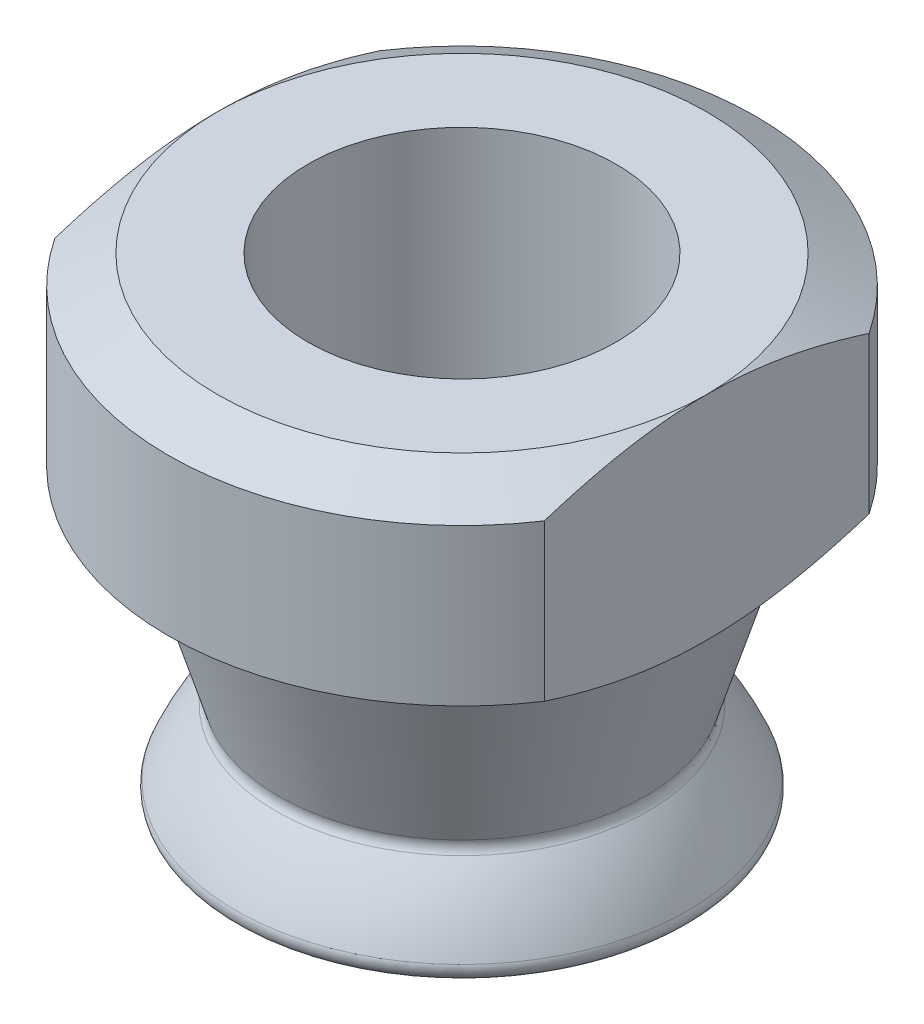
ISO-10303-21;
HEADER;
FILE_DESCRIPTION(('STEP AP214'),'2;1');
FILE_NAME('part.step','',(''),(''),'','','');
FILE_SCHEMA(('AUTOMOTIVE_DESIGN { 1 0 10303 214 1 1 1 1 }'));
ENDSEC;
DATA;
#1=APPLICATION_CONTEXT('core data for automotive mechanical design processes');
#2=APPLICATION_PROTOCOL_DEFINITION('international standard','automotive_design',2000,#1);
#3=PRODUCT_CONTEXT('',#1,'mechanical');
#4=PRODUCT('Part','Part','',(#3));
#5=PRODUCT_RELATED_PRODUCT_CATEGORY('part','',(#4));
#6=PRODUCT_DEFINITION_FORMATION('','',#4);
#7=PRODUCT_DEFINITION_CONTEXT('part definition',#1,'design');
#8=PRODUCT_DEFINITION('design','',#6,#7);
#9=PRODUCT_DEFINITION_SHAPE('','',#8);
#10=(LENGTH_UNIT() NAMED_UNIT(*) SI_UNIT(.MILLI.,.METRE.));
#11=(NAMED_UNIT(*) PLANE_ANGLE_UNIT() SI_UNIT($,.RADIAN.));
#12=(NAMED_UNIT(*) SI_UNIT($,.STERADIAN.) SOLID_ANGLE_UNIT());
#13=UNCERTAINTY_MEASURE_WITH_UNIT(LENGTH_MEASURE(1.E-05),#10,'distance_accuracy_value','');
#14=(GEOMETRIC_REPRESENTATION_CONTEXT(3) GLOBAL_UNCERTAINTY_ASSIGNED_CONTEXT((#13)) GLOBAL_UNIT_ASSIGNED_CONTEXT((#10,
#11,#12)) REPRESENTATION_CONTEXT('',''));
#15=CARTESIAN_POINT('',(0.,0.,0.));
#16=DIRECTION('',(0.,0.,1.));
#17=DIRECTION('',(1.,0.,0.));
#18=AXIS2_PLACEMENT_3D('',#15,#16,#17);
#19=CARTESIAN_POINT('',(0.,7.30134533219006,0.));
#20=DIRECTION('',(0.,-1.,0.));
#21=DIRECTION('',(0.,0.,-1.));
#22=AXIS2_PLACEMENT_3D('',#19,#20,#21);
#23=TOROIDAL_SURFACE('',#22,6.3373,0.4064);
#24=CARTESIAN_POINT('',(0.,7.42016519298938,0.));
#25=DIRECTION('',(0.,-1.,0.));
#26=DIRECTION('',(0.,0.,-1.));
#27=AXIS2_PLACEMENT_3D('',#24,#25,#26);
#28=CIRCLE('',#27,5.94865774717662);
#29=CARTESIAN_POINT('',(0.,7.42016519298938,-5.94865774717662));
#30=VERTEX_POINT('',#29);
#31=EDGE_CURVE('E78',#30,#30,#28,.T.);
#32=ORIENTED_EDGE('',*,*,#31,.T.);
#33=EDGE_LOOP('',(#32));
#34=FACE_BOUND('',#33,.T.);
#35=CARTESIAN_POINT('',(0.,7.03643856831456,0.));
#36=DIRECTION('',(0.,-1.,0.));
#37=DIRECTION('',(0.,0.,-1.));
#38=AXIS2_PLACEMENT_3D('',#35,#36,#37);
#39=CIRCLE('',#38,6.02910303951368);
#40=CARTESIAN_POINT('',(0.,7.03643856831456,-6.02910303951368));
#41=VERTEX_POINT('',#40);
#42=EDGE_CURVE('E29',#41,#41,#39,.T.);
#43=ORIENTED_EDGE('',*,*,#42,.F.);
#44=EDGE_LOOP('',(#43));
#45=FACE_BOUND('',#44,.T.);
#46=ADVANCED_FACE('F14',(#34,#45),#23,.F.);
#47=CARTESIAN_POINT('',(0.,4.75612040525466,0.));
#48=DIRECTION('',(0.,-1.,0.));
#49=DIRECTION('',(0.,0.,-1.));
#50=AXIS2_PLACEMENT_3D('',#47,#48,#49);
#51=TOROIDAL_SURFACE('',#50,6.97432216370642,0.39624);
#52=CARTESIAN_POINT('',(0.,4.3637365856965,0.));
#53=DIRECTION('',(0.,-1.,0.));
#54=DIRECTION('',(0.,0.,-1.));
#55=AXIS2_PLACEMENT_3D('',#52,#53,#54);
#56=CIRCLE('',#55,7.02946811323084);
#57=CARTESIAN_POINT('',(0.,4.3637365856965,-7.02946811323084));
#58=VERTEX_POINT('',#57);
#59=EDGE_CURVE('E116',#58,#58,#56,.T.);
#60=ORIENTED_EDGE('',*,*,#59,.F.);
#61=EDGE_LOOP('',(#60));
#62=FACE_BOUND('',#61,.T.);
#63=CARTESIAN_POINT('',(0.,4.90833949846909,0.));
#64=DIRECTION('',(0.,1.,0.));
#65=DIRECTION('',(0.,0.,-1.));
#66=AXIS2_PLACEMENT_3D('',#63,#64,#65);
#67=CIRCLE('',#66,7.3401574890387);
#68=CARTESIAN_POINT('',(0.,4.90833949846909,-7.3401574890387));
#69=VERTEX_POINT('',#68);
#70=EDGE_CURVE('E210',#69,#69,#67,.T.);
#71=ORIENTED_EDGE('',*,*,#70,.F.);
#72=EDGE_LOOP('',(#71));
#73=FACE_BOUND('',#72,.T.);
#74=ADVANCED_FACE('F171',(#62,#73),#51,.T.);
#75=CARTESIAN_POINT('',(0.,7.42016519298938,0.));
#76=DIRECTION('',(0.,1.,0.));
#77=DIRECTION('',(0.,0.,1.));
#78=AXIS2_PLACEMENT_3D('',#75,#76,#77);
#79=CONICAL_SURFACE('',#78,5.94865774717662,0.296705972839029);
#80=CARTESIAN_POINT('',(0.,12.55395,0.));
#81=DIRECTION('',(0.,-1.,0.));
#82=DIRECTION('',(0.,0.,-1.));
#83=AXIS2_PLACEMENT_3D('',#80,#81,#82);
#84=CIRCLE('',#83,7.51821327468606);
#85=CARTESIAN_POINT('',(0.,12.55395,-7.51821327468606));
#86=VERTEX_POINT('',#85);
#87=EDGE_CURVE('E9',#86,#86,#84,.T.);
#88=ORIENTED_EDGE('',*,*,#87,.T.);
#89=EDGE_LOOP('',(#88));
#90=FACE_BOUND('',#89,.T.);
#91=ORIENTED_EDGE('',*,*,#31,.F.);
#92=EDGE_LOOP('',(#91));
#93=FACE_BOUND('',#92,.T.);
#94=ADVANCED_FACE('F178',(#90,#93),#79,.T.);
#95=CARTESIAN_POINT('',(0.,1.8542,0.));
#96=DIRECTION('',(0.,0.,1.));
#97=DIRECTION('',(1.,0.,0.));
#98=AXIS2_PLACEMENT_3D('',#95,#96,#97);
#99=SPHERICAL_SURFACE('',#98,7.9502);
#100=CARTESIAN_POINT('',(0.,1.8542,0.));
#101=DIRECTION('',(0.,1.,0.));
#102=DIRECTION('',(0.,0.,-1.));
#103=AXIS2_PLACEMENT_3D('',#100,#101,#102);
#104=SPHERICAL_SURFACE('',#103,7.9502);
#105=ORIENTED_EDGE('',*,*,#70,.T.);
#106=EDGE_LOOP('',(#105));
#107=FACE_BOUND('',#106,.T.);
#108=ORIENTED_EDGE('',*,*,#42,.T.);
#109=EDGE_LOOP('',(#108));
#110=FACE_BOUND('',#109,.T.);
#111=ADVANCED_FACE('F189',(#107,#110),#104,.T.);
#112=CARTESIAN_POINT('',(0.,3.9751,0.));
#113=DIRECTION('',(0.,1.,0.));
#114=DIRECTION('',(0.,0.,1.));
#115=AXIS2_PLACEMENT_3D('',#112,#113,#114);
#116=CONICAL_SURFACE('',#115,4.26417511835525,1.43116998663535);
#117=ORIENTED_EDGE('',*,*,#59,.T.);
#118=EDGE_LOOP('',(#117));
#119=FACE_BOUND('',#118,.T.);
#120=CARTESIAN_POINT('',(0.,3.9751,0.));
#121=DIRECTION('',(0.,-1.,0.));
#122=DIRECTION('',(0.,0.,-1.));
#123=AXIS2_PLACEMENT_3D('',#120,#121,#122);
#124=CIRCLE('',#123,4.26417511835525);
#125=CARTESIAN_POINT('',(0.,3.9751,-4.26417511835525));
#126=VERTEX_POINT('',#125);
#127=EDGE_CURVE('E89',#126,#126,#124,.T.);
#128=ORIENTED_EDGE('',*,*,#127,.F.);
#129=EDGE_LOOP('',(#128));
#130=FACE_BOUND('',#129,.T.);
#131=ADVANCED_FACE('F169',(#119,#130),#116,.T.);
#132=CARTESIAN_POINT('',(0.,18.7811564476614,0.));
#133=DIRECTION('',(0.,-1.,0.));
#134=DIRECTION('',(0.,0.,-1.));
#135=AXIS2_PLACEMENT_3D('',#132,#133,#134);
#136=CONICAL_SURFACE('',#135,9.525,1.0471975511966);
#137=CARTESIAN_POINT('',(0.,19.6977,0.));
#138=DIRECTION('',(0.,-1.,0.));
#139=DIRECTION('',(0.,0.,-1.));
#140=AXIS2_PLACEMENT_3D('',#137,#138,#139);
#141=CIRCLE('',#140,7.9375);
#142=CARTESIAN_POINT('',(-7.9375,19.6977,0.));
#143=VERTEX_POINT('',#142);
#144=CARTESIAN_POINT('',(7.9375,19.6977,0.));
#145=VERTEX_POINT('',#144);
#146=EDGE_CURVE('E114',#143,#145,#141,.T.);
#147=ORIENTED_EDGE('',*,*,#146,.T.);
#148=CARTESIAN_POINT('',(7.9375,18.7811564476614,-5.2651418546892));
#149=CARTESIAN_POINT('',(7.9375,18.8492513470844,-5.05173579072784));
#150=CARTESIAN_POINT('',(7.9375,18.914765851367,-4.83748007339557));
#151=CARTESIAN_POINT('',(7.9375,19.0397998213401,-4.40715380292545));
#152=CARTESIAN_POINT('',(7.9375,19.0993173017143,-4.19108267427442));
#153=CARTESIAN_POINT('',(7.9375,19.2111307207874,-3.75849018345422));
#154=CARTESIAN_POINT('',(7.9375,19.2634689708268,-3.54197983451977));
#155=CARTESIAN_POINT('',(7.9375,19.3604347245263,-3.10724699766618));
#156=CARTESIAN_POINT('',(7.9375,19.4050628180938,-2.88902464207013));
#157=CARTESIAN_POINT('',(7.9375,19.4857686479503,-2.45057370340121));
#158=CARTESIAN_POINT('',(7.9375,19.5218303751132,-2.23034215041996));
#159=CARTESIAN_POINT('',(7.9375,19.5844296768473,-1.78853418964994));
#160=CARTESIAN_POINT('',(7.9375,19.6109677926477,-1.56695785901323));
#161=CARTESIAN_POINT('',(7.9375,19.6539333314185,-1.12145532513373));
#162=CARTESIAN_POINT('',(7.9375,19.6702986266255,-0.89752301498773));
#163=CARTESIAN_POINT('',(7.9375,19.6867135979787,-0.561205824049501));
#164=CARTESIAN_POINT('',(7.9375,19.6908297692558,-0.449007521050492));
#165=CARTESIAN_POINT('',(7.9375,19.6963243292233,-0.224541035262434));
#166=CARTESIAN_POINT('',(7.9375,19.6977026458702,-0.112272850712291));
#167=CARTESIAN_POINT('',(7.9375,19.6977,0.));
#168=B_SPLINE_CURVE_WITH_KNOTS('',3,(#148,#149,#150,#151,#152,#153,#154,#155,#156,#157,#158,
#159,#160,#161,#162,#163,#164,#165,#166,#167),.UNSPECIFIED.,.F.,.F.,(4,2,2,2,2,2,2,2,2,4),(0.,
0.672041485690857,1.3443047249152,2.01241800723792,2.68048014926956,3.34978113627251,
4.0190440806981,4.69235521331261,5.02914734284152,5.36594833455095),.UNSPECIFIED.);
#169=CARTESIAN_POINT('',(7.9375,18.7811564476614,-5.2651418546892));
#170=VERTEX_POINT('',#169);
#171=EDGE_CURVE('E98',#170,#145,#168,.T.);
#172=ORIENTED_EDGE('',*,*,#171,.F.);
#173=CARTESIAN_POINT('',(0.,18.7811564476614,0.));
#174=DIRECTION('',(0.,-1.,0.));
#175=DIRECTION('',(0.,0.,-1.));
#176=AXIS2_PLACEMENT_3D('',#173,#174,#175);
#177=CIRCLE('',#176,9.525);
#178=CARTESIAN_POINT('',(-7.9375,18.7811564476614,-5.2651418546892));
#179=VERTEX_POINT('',#178);
#180=EDGE_CURVE('E88',#179,#170,#177,.T.);
#181=ORIENTED_EDGE('',*,*,#180,.F.);
#182=CARTESIAN_POINT('',(-7.9375,19.6977,0.));
#183=CARTESIAN_POINT('',(-7.9375,19.6977026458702,-0.112272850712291));
#184=CARTESIAN_POINT('',(-7.9375,19.6963243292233,-0.224541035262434));
#185=CARTESIAN_POINT('',(-7.9375,19.6908297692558,-0.449007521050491));
#186=CARTESIAN_POINT('',(-7.9375,19.6867135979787,-0.561205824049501));
#187=CARTESIAN_POINT('',(-7.9375,19.6702986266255,-0.897523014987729));
#188=CARTESIAN_POINT('',(-7.9375,19.6539333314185,-1.12145532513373));
#189=CARTESIAN_POINT('',(-7.9375,19.6109677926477,-1.56695785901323));
#190=CARTESIAN_POINT('',(-7.9375,19.5844296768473,-1.78853418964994));
#191=CARTESIAN_POINT('',(-7.9375,19.5218303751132,-2.23034215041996));
#192=CARTESIAN_POINT('',(-7.9375,19.4857686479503,-2.45057370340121));
#193=CARTESIAN_POINT('',(-7.9375,19.4050628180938,-2.88902464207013));
#194=CARTESIAN_POINT('',(-7.9375,19.3604347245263,-3.10724699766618));
#195=CARTESIAN_POINT('',(-7.9375,19.2634689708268,-3.54197983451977));
#196=CARTESIAN_POINT('',(-7.9375,19.2111307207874,-3.75849018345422));
#197=CARTESIAN_POINT('',(-7.9375,19.0993173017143,-4.19108267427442));
#198=CARTESIAN_POINT('',(-7.9375,19.0397998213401,-4.40715380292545));
#199=CARTESIAN_POINT('',(-7.9375,18.914765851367,-4.83748007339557));
#200=CARTESIAN_POINT('',(-7.9375,18.8492513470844,-5.05173579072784));
#201=CARTESIAN_POINT('',(-7.9375,18.7811564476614,-5.2651418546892));
#202=B_SPLINE_CURVE_WITH_KNOTS('',3,(#182,#183,#184,#185,#186,#187,#188,#189,#190,#191,#192,
#193,#194,#195,#196,#197,#198,#199,#200,#201),.UNSPECIFIED.,.F.,.F.,(4,2,2,2,2,2,2,2,2,4),(0.,
0.336800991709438,0.673593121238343,1.34690425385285,2.01616719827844,2.68546818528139,
3.35353032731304,4.02164360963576,4.6939068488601,5.36594833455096),.UNSPECIFIED.);
#203=EDGE_CURVE('E19',#143,#179,#202,.T.);
#204=ORIENTED_EDGE('',*,*,#203,.F.);
#205=EDGE_LOOP('',(#147,#172,#181,#204));
#206=FACE_BOUND('',#205,.T.);
#207=ADVANCED_FACE('F157',(#206),#136,.T.);
#208=CARTESIAN_POINT('',(0.,1.8542,0.));
#209=DIRECTION('',(0.,-1.,0.));
#210=DIRECTION('',(0.,0.,-1.));
#211=AXIS2_PLACEMENT_3D('',#208,#209,#210);
#212=CYLINDRICAL_SURFACE('',#211,9.525);
#213=ORIENTED_EDGE('',*,*,#180,.T.);
#214=DIRECTION('',(0.,1.,0.));
#215=VECTOR('',#214,1.);
#216=CARTESIAN_POINT('',(7.9375,1.8542,-5.2651418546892));
#217=LINE('',#216,#215);
#218=CARTESIAN_POINT('',(7.9375,13.7125688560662,-5.2651418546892));
#219=VERTEX_POINT('',#218);
#220=EDGE_CURVE('E79',#219,#170,#217,.T.);
#221=ORIENTED_EDGE('',*,*,#220,.F.);
#222=CARTESIAN_POINT('',(0.,13.7125688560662,0.));
#223=DIRECTION('',(0.,-1.,0.));
#224=DIRECTION('',(0.,0.,-1.));
#225=AXIS2_PLACEMENT_3D('',#222,#223,#224);
#226=CIRCLE('',#225,9.525);
#227=CARTESIAN_POINT('',(-7.9375,13.7125688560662,-5.2651418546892));
#228=VERTEX_POINT('',#227);
#229=EDGE_CURVE('E73',#228,#219,#226,.T.);
#230=ORIENTED_EDGE('',*,*,#229,.F.);
#231=DIRECTION('',(0.,-1.,0.));
#232=VECTOR('',#231,1.);
#233=CARTESIAN_POINT('',(-7.9375,1.8542,-5.2651418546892));
#234=LINE('',#233,#232);
#235=EDGE_CURVE('E108',#179,#228,#234,.T.);
#236=ORIENTED_EDGE('',*,*,#235,.F.);
#237=EDGE_LOOP('',(#213,#221,#230,#236));
#238=FACE_BOUND('',#237,.T.);
#239=ADVANCED_FACE('F160',(#238),#212,.T.);
#240=CARTESIAN_POINT('',(0.,12.55395,0.));
#241=DIRECTION('',(0.,1.,0.));
#242=DIRECTION('',(0.,0.,1.));
#243=AXIS2_PLACEMENT_3D('',#240,#241,#242);
#244=CONICAL_SURFACE('',#243,7.51821327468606,1.0471975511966);
#245=CARTESIAN_POINT('',(0.,13.7125688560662,0.));
#246=DIRECTION('',(0.,-1.,0.));
#247=DIRECTION('',(0.,0.,-1.));
#248=AXIS2_PLACEMENT_3D('',#245,#246,#247);
#249=CIRCLE('',#248,9.525);
#250=CARTESIAN_POINT('',(7.9375,13.7125688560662,5.2651418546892));
#251=VERTEX_POINT('',#250);
#252=CARTESIAN_POINT('',(-7.9375,13.7125688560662,5.26514185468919));
#253=VERTEX_POINT('',#252);
#254=EDGE_CURVE('E70',#251,#253,#249,.T.);
#255=ORIENTED_EDGE('',*,*,#254,.T.);
#256=CARTESIAN_POINT('',(-7.9375,13.7125688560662,-5.2651418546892));
#257=CARTESIAN_POINT('',(-7.9375,13.6463392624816,-5.05757474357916));
#258=CARTESIAN_POINT('',(-7.9375,13.5825573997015,-4.84923718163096));
#259=CARTESIAN_POINT('',(-7.9375,13.4606418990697,-4.43084666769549));
#260=CARTESIAN_POINT('',(-7.9375,13.4025100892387,-4.2207931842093));
#261=CARTESIAN_POINT('',(-7.9375,13.2374438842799,-3.58670077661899));
#262=CARTESIAN_POINT('',(-7.9375,13.1402559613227,-3.16000598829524));
#263=CARTESIAN_POINT('',(-7.9375,13.0203303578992,-2.52141421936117));
#264=CARTESIAN_POINT('',(-7.9375,12.9850018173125,-2.31184137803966));
#265=CARTESIAN_POINT('',(-7.9375,12.9228794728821,-1.89144324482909));
#266=CARTESIAN_POINT('',(-7.9375,12.8960845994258,-1.68061811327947));
#267=CARTESIAN_POINT('',(-7.9375,12.8517063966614,-1.25831643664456));
#268=CARTESIAN_POINT('',(-7.9375,12.8341092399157,-1.04684135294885));
#269=CARTESIAN_POINT('',(-7.9375,12.8085248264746,-0.623306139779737));
#270=CARTESIAN_POINT('',(-7.9375,12.8005375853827,-0.41124600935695));
#271=CARTESIAN_POINT('',(-7.9375,12.7941633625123,0.0291123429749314));
#272=CARTESIAN_POINT('',(-7.9375,12.7965504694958,0.257422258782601));
#273=CARTESIAN_POINT('',(-7.9375,12.8126313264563,0.713643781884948));
#274=CARTESIAN_POINT('',(-7.9375,12.8263253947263,0.941555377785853));
#275=CARTESIAN_POINT('',(-7.9375,12.8646269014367,1.3968644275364));
#276=CARTESIAN_POINT('',(-7.9375,12.8892537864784,1.62426023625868));
#277=CARTESIAN_POINT('',(-7.9375,12.9487028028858,2.07768814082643));
#278=CARTESIAN_POINT('',(-7.9375,12.9835247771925,2.30372025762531));
#279=CARTESIAN_POINT('',(-7.9375,13.1044018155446,2.99335380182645));
#280=CARTESIAN_POINT('',(-7.9375,13.2055952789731,3.45435275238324));
#281=CARTESIAN_POINT('',(-7.9375,13.3802661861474,4.13888115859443));
#282=CARTESIAN_POINT('',(-7.9375,13.4421800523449,4.36552033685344));
#283=CARTESIAN_POINT('',(-7.9375,13.5726413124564,4.81678394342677));
#284=CARTESIAN_POINT('',(-7.9375,13.6411859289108,5.04140917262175));
#285=CARTESIAN_POINT('',(-7.9375,13.7125688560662,5.26514185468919));
#286=B_SPLINE_CURVE_WITH_KNOTS('',3,(#256,#257,#258,#259,#260,#261,#262,#263,#264,#265,#266,
#267,#268,#269,#270,#271,#272,#273,#274,#275,#276,#277,#278,#279,#280,#281,#282,#283,#284,#285),
.UNSPECIFIED.,.F.,.F.,(4,2,2,2,2,2,2,2,2,2,2,2,2,2,4),(0.,0.65358491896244,1.30738060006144,
2.61899437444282,3.25644361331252,3.89381292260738,4.53022126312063,5.16663063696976,
5.8513091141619,6.53600686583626,7.22192742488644,7.90783741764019,9.32210495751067,
10.026872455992,10.7313460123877),.UNSPECIFIED.);
#287=EDGE_CURVE('E96',#228,#253,#286,.T.);
#288=ORIENTED_EDGE('',*,*,#287,.F.);
#289=ORIENTED_EDGE('',*,*,#229,.T.);
#290=CARTESIAN_POINT('',(7.9375,13.7125688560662,5.2651418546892));
#291=CARTESIAN_POINT('',(7.9375,13.6463392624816,5.05757474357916));
#292=CARTESIAN_POINT('',(7.9375,13.5825573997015,4.84923718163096));
#293=CARTESIAN_POINT('',(7.9375,13.4606418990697,4.43084666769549));
#294=CARTESIAN_POINT('',(7.9375,13.4025100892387,4.2207931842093));
#295=CARTESIAN_POINT('',(7.9375,13.2374438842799,3.58670077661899));
#296=CARTESIAN_POINT('',(7.9375,13.1402559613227,3.16000598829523));
#297=CARTESIAN_POINT('',(7.9375,13.0203303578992,2.52141421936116));
#298=CARTESIAN_POINT('',(7.9375,12.9850018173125,2.31184137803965));
#299=CARTESIAN_POINT('',(7.9375,12.9228794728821,1.89144324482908));
#300=CARTESIAN_POINT('',(7.9375,12.8960845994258,1.68061811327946));
#301=CARTESIAN_POINT('',(7.9375,12.8517063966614,1.25831643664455));
#302=CARTESIAN_POINT('',(7.9375,12.8341092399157,1.04684135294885));
#303=CARTESIAN_POINT('',(7.9375,12.8085248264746,0.623306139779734));
#304=CARTESIAN_POINT('',(7.9375,12.8005375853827,0.411246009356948));
#305=CARTESIAN_POINT('',(7.9375,12.7941633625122,-0.0291123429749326));
#306=CARTESIAN_POINT('',(7.9375,12.7965504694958,-0.257422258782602));
#307=CARTESIAN_POINT('',(7.9375,12.8126313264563,-0.71364378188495));
#308=CARTESIAN_POINT('',(7.9375,12.8263253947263,-0.941555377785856));
#309=CARTESIAN_POINT('',(7.9375,12.8646269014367,-1.3968644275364));
#310=CARTESIAN_POINT('',(7.9375,12.8892537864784,-1.62426023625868));
#311=CARTESIAN_POINT('',(7.9375,12.9487028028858,-2.07768814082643));
#312=CARTESIAN_POINT('',(7.9375,12.9835247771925,-2.30372025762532));
#313=CARTESIAN_POINT('',(7.9375,13.1044018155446,-2.99335380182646));
#314=CARTESIAN_POINT('',(7.9375,13.2055952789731,-3.45435275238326));
#315=CARTESIAN_POINT('',(7.9375,13.3802661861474,-4.13888115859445));
#316=CARTESIAN_POINT('',(7.9375,13.4421800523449,-4.36552033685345));
#317=CARTESIAN_POINT('',(7.9375,13.5726413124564,-4.81678394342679));
#318=CARTESIAN_POINT('',(7.9375,13.6411859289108,-5.04140917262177));
#319=CARTESIAN_POINT('',(7.9375,13.7125688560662,-5.26514185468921));
#320=B_SPLINE_CURVE_WITH_KNOTS('',3,(#290,#291,#292,#293,#294,#295,#296,#297,#298,#299,#300,
#301,#302,#303,#304,#305,#306,#307,#308,#309,#310,#311,#312,#313,#314,#315,#316,#317,#318,#319),
.UNSPECIFIED.,.F.,.F.,(4,2,2,2,2,2,2,2,2,2,2,2,2,2,4),(0.,0.65358491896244,1.30738060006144,
2.61899437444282,3.25644361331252,3.89381292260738,4.53022126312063,5.16663063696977,
5.85130911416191,6.53600686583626,7.22192742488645,7.90783741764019,9.32210495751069,
10.026872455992,10.7313460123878),.UNSPECIFIED.);
#321=EDGE_CURVE('E65',#251,#219,#320,.T.);
#322=ORIENTED_EDGE('',*,*,#321,.F.);
#323=EDGE_LOOP('',(#255,#288,#289,#322));
#324=FACE_BOUND('',#323,.T.);
#325=ORIENTED_EDGE('',*,*,#87,.F.);
#326=EDGE_LOOP('',(#325));
#327=FACE_BOUND('',#326,.T.);
#328=ADVANCED_FACE('F67',(#324,#327),#244,.T.);
#329=CARTESIAN_POINT('',(0.,1.8542,0.));
#330=DIRECTION('',(0.,0.,1.));
#331=DIRECTION('',(1.,0.,0.));
#332=AXIS2_PLACEMENT_3D('',#329,#330,#331);
#333=SPHERICAL_SURFACE('',#332,4.7625);
#334=CARTESIAN_POINT('',(0.,1.8542,0.));
#335=DIRECTION('',(0.,-1.,0.));
#336=DIRECTION('',(0.,0.,-1.));
#337=AXIS2_PLACEMENT_3D('',#334,#335,#336);
#338=SPHERICAL_SURFACE('',#337,4.7625);
#339=ORIENTED_EDGE('',*,*,#127,.T.);
#340=EDGE_LOOP('',(#339));
#341=FACE_BOUND('',#340,.T.);
#342=ADVANCED_FACE('F168',(#341),#338,.F.);
#343=CARTESIAN_POINT('',(7.9375,19.6977,0.));
#344=DIRECTION('',(0.,1.,0.));
#345=DIRECTION('',(0.,0.,1.));
#346=AXIS2_PLACEMENT_3D('',#343,#344,#345);
#347=PLANE('',#346);
#348=CARTESIAN_POINT('',(0.,19.6977,0.));
#349=DIRECTION('',(0.,1.,0.));
#350=DIRECTION('',(0.,0.,1.));
#351=AXIS2_PLACEMENT_3D('',#348,#349,#350);
#352=CIRCLE('',#351,5.);
#353=CARTESIAN_POINT('',(0.,19.6977,5.));
#354=VERTEX_POINT('',#353);
#355=EDGE_CURVE('E215',#354,#354,#352,.T.);
#356=ORIENTED_EDGE('',*,*,#355,.F.);
#357=EDGE_LOOP('',(#356));
#358=FACE_BOUND('',#357,.T.);
#359=CARTESIAN_POINT('',(0.,19.6977,0.));
#360=DIRECTION('',(0.,-1.,0.));
#361=DIRECTION('',(0.,0.,-1.));
#362=AXIS2_PLACEMENT_3D('',#359,#360,#361);
#363=CIRCLE('',#362,7.9375);
#364=EDGE_CURVE('E104',#145,#143,#363,.T.);
#365=ORIENTED_EDGE('',*,*,#364,.F.);
#366=ORIENTED_EDGE('',*,*,#146,.F.);
#367=EDGE_LOOP('',(#365,#366));
#368=FACE_BOUND('',#367,.T.);
#369=ADVANCED_FACE('F155',(#358,#368),#347,.T.);
#370=CARTESIAN_POINT('',(0.,1.8542,0.));
#371=DIRECTION('',(0.,-1.,0.));
#372=DIRECTION('',(0.,0.,-1.));
#373=AXIS2_PLACEMENT_3D('',#370,#371,#372);
#374=CYLINDRICAL_SURFACE('',#373,9.525);
#375=DIRECTION('',(0.,1.,0.));
#376=VECTOR('',#375,1.);
#377=CARTESIAN_POINT('',(-7.9375,1.8542,5.26514185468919));
#378=LINE('',#377,#376);
#379=CARTESIAN_POINT('',(-7.9375,18.7811564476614,5.26514185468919));
#380=VERTEX_POINT('',#379);
#381=EDGE_CURVE('E86',#253,#380,#378,.T.);
#382=ORIENTED_EDGE('',*,*,#381,.F.);
#383=ORIENTED_EDGE('',*,*,#254,.F.);
#384=DIRECTION('',(0.,-1.,0.));
#385=VECTOR('',#384,1.);
#386=CARTESIAN_POINT('',(7.9375,1.8542,5.2651418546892));
#387=LINE('',#386,#385);
#388=CARTESIAN_POINT('',(7.9375,18.7811564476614,5.2651418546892));
#389=VERTEX_POINT('',#388);
#390=EDGE_CURVE('E84',#389,#251,#387,.T.);
#391=ORIENTED_EDGE('',*,*,#390,.F.);
#392=CARTESIAN_POINT('',(0.,18.7811564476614,0.));
#393=DIRECTION('',(0.,-1.,0.));
#394=DIRECTION('',(0.,0.,-1.));
#395=AXIS2_PLACEMENT_3D('',#392,#393,#394);
#396=CIRCLE('',#395,9.525);
#397=EDGE_CURVE('E106',#389,#380,#396,.T.);
#398=ORIENTED_EDGE('',*,*,#397,.T.);
#399=EDGE_LOOP('',(#382,#383,#391,#398));
#400=FACE_BOUND('',#399,.T.);
#401=ADVANCED_FACE('F82',(#400),#374,.T.);
#402=CARTESIAN_POINT('',(0.,18.7811564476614,0.));
#403=DIRECTION('',(0.,-1.,0.));
#404=DIRECTION('',(0.,0.,-1.));
#405=AXIS2_PLACEMENT_3D('',#402,#403,#404);
#406=CONICAL_SURFACE('',#405,9.525,1.0471975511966);
#407=CARTESIAN_POINT('',(-7.9375,18.7811564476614,5.26514185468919));
#408=CARTESIAN_POINT('',(-7.9375,18.8492513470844,5.05173579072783));
#409=CARTESIAN_POINT('',(-7.9375,18.9147658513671,4.83748007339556));
#410=CARTESIAN_POINT('',(-7.9375,19.0397998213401,4.40715380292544));
#411=CARTESIAN_POINT('',(-7.9375,19.0993173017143,4.19108267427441));
#412=CARTESIAN_POINT('',(-7.9375,19.2111307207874,3.75849018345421));
#413=CARTESIAN_POINT('',(-7.9375,19.2634689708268,3.54197983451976));
#414=CARTESIAN_POINT('',(-7.9375,19.3604347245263,3.10724699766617));
#415=CARTESIAN_POINT('',(-7.9375,19.4050628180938,2.88902464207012));
#416=CARTESIAN_POINT('',(-7.9375,19.4857686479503,2.4505737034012));
#417=CARTESIAN_POINT('',(-7.9375,19.5218303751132,2.23034215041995));
#418=CARTESIAN_POINT('',(-7.9375,19.5844296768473,1.78853418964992));
#419=CARTESIAN_POINT('',(-7.9375,19.6109677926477,1.56695785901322));
#420=CARTESIAN_POINT('',(-7.9375,19.6539333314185,1.12145532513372));
#421=CARTESIAN_POINT('',(-7.9375,19.6702986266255,0.89752301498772));
#422=CARTESIAN_POINT('',(-7.9375,19.6867135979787,0.561205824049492));
#423=CARTESIAN_POINT('',(-7.9375,19.6908297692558,0.449007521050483));
#424=CARTESIAN_POINT('',(-7.9375,19.6963243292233,0.224541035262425));
#425=CARTESIAN_POINT('',(-7.9375,19.6977026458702,0.112272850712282));
#426=CARTESIAN_POINT('',(-7.9375,19.6977,0.));
#427=B_SPLINE_CURVE_WITH_KNOTS('',3,(#407,#408,#409,#410,#411,#412,#413,#414,#415,#416,#417,
#418,#419,#420,#421,#422,#423,#424,#425,#426),.UNSPECIFIED.,.F.,.F.,(4,2,2,2,2,2,2,2,2,4),(0.,
0.672041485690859,1.3443047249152,2.01241800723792,2.68048014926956,3.34978113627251,
4.0190440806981,4.69235521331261,5.02914734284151,5.36594833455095),.UNSPECIFIED.);
#428=EDGE_CURVE('E113',#380,#143,#427,.T.);
#429=ORIENTED_EDGE('',*,*,#428,.F.);
#430=ORIENTED_EDGE('',*,*,#397,.F.);
#431=CARTESIAN_POINT('',(7.9375,19.6977,0.));
#432=CARTESIAN_POINT('',(7.9375,19.6977026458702,0.112272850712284));
#433=CARTESIAN_POINT('',(7.9375,19.6963243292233,0.224541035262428));
#434=CARTESIAN_POINT('',(7.9375,19.6908297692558,0.449007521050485));
#435=CARTESIAN_POINT('',(7.9375,19.6867135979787,0.561205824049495));
#436=CARTESIAN_POINT('',(7.9375,19.6702986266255,0.897523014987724));
#437=CARTESIAN_POINT('',(7.9375,19.6539333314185,1.12145532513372));
#438=CARTESIAN_POINT('',(7.9375,19.6109677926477,1.56695785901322));
#439=CARTESIAN_POINT('',(7.9375,19.5844296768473,1.78853418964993));
#440=CARTESIAN_POINT('',(7.9375,19.5218303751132,2.23034215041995));
#441=CARTESIAN_POINT('',(7.9375,19.4857686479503,2.45057370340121));
#442=CARTESIAN_POINT('',(7.9375,19.4050628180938,2.88902464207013));
#443=CARTESIAN_POINT('',(7.9375,19.3604347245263,3.10724699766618));
#444=CARTESIAN_POINT('',(7.9375,19.2634689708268,3.54197983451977));
#445=CARTESIAN_POINT('',(7.9375,19.2111307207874,3.75849018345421));
#446=CARTESIAN_POINT('',(7.9375,19.0993173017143,4.19108267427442));
#447=CARTESIAN_POINT('',(7.9375,19.0397998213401,4.40715380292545));
#448=CARTESIAN_POINT('',(7.9375,18.914765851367,4.83748007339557));
#449=CARTESIAN_POINT('',(7.9375,18.8492513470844,5.05173579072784));
#450=CARTESIAN_POINT('',(7.9375,18.7811564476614,5.2651418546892));
#451=B_SPLINE_CURVE_WITH_KNOTS('',3,(#431,#432,#433,#434,#435,#436,#437,#438,#439,#440,#441,
#442,#443,#444,#445,#446,#447,#448,#449,#450),.UNSPECIFIED.,.F.,.F.,(4,2,2,2,2,2,2,2,2,4),(0.,
0.336800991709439,0.673593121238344,1.34690425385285,2.01616719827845,2.6854681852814,
3.35353032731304,4.02164360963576,4.6939068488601,5.36594833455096),.UNSPECIFIED.);
#452=EDGE_CURVE('E95',#145,#389,#451,.T.);
#453=ORIENTED_EDGE('',*,*,#452,.F.);
#454=ORIENTED_EDGE('',*,*,#364,.T.);
#455=EDGE_LOOP('',(#429,#430,#453,#454));
#456=FACE_BOUND('',#455,.T.);
#457=ADVANCED_FACE('F133',(#456),#406,.T.);
#458=CARTESIAN_POINT('',(7.9375,19.6977,-15.0781431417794));
#459=DIRECTION('',(-1.,0.,0.));
#460=DIRECTION('',(0.,0.,1.));
#461=AXIS2_PLACEMENT_3D('',#458,#459,#460);
#462=PLANE('',#461);
#463=ORIENTED_EDGE('',*,*,#321,.T.);
#464=ORIENTED_EDGE('',*,*,#220,.T.);
#465=ORIENTED_EDGE('',*,*,#171,.T.);
#466=ORIENTED_EDGE('',*,*,#452,.T.);
#467=ORIENTED_EDGE('',*,*,#390,.T.);
#468=EDGE_LOOP('',(#463,#464,#465,#466,#467));
#469=FACE_BOUND('',#468,.T.);
#470=ADVANCED_FACE('F92',(#469),#462,.F.);
#471=CARTESIAN_POINT('',(-7.9375,19.6977,-15.0781431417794));
#472=DIRECTION('',(1.,0.,0.));
#473=DIRECTION('',(0.,0.,-1.));
#474=AXIS2_PLACEMENT_3D('',#471,#472,#473);
#475=PLANE('',#474);
#476=ORIENTED_EDGE('',*,*,#287,.T.);
#477=ORIENTED_EDGE('',*,*,#381,.T.);
#478=ORIENTED_EDGE('',*,*,#428,.T.);
#479=ORIENTED_EDGE('',*,*,#203,.T.);
#480=ORIENTED_EDGE('',*,*,#235,.T.);
#481=EDGE_LOOP('',(#476,#477,#478,#479,#480));
#482=FACE_BOUND('',#481,.T.);
#483=ADVANCED_FACE('F16',(#482),#475,.F.);
#484=CARTESIAN_POINT('',(0.,11.6977,0.));
#485=DIRECTION('',(0.,1.,0.));
#486=DIRECTION('',(0.,0.,1.));
#487=AXIS2_PLACEMENT_3D('',#484,#485,#486);
#488=CYLINDRICAL_SURFACE('',#487,5.);
#489=CARTESIAN_POINT('',(0.,11.6977,0.));
#490=DIRECTION('',(0.,1.,0.));
#491=DIRECTION('',(0.,0.,1.));
#492=AXIS2_PLACEMENT_3D('',#489,#490,#491);
#493=CIRCLE('',#492,5.);
#494=CARTESIAN_POINT('',(0.,11.6977,5.));
#495=VERTEX_POINT('',#494);
#496=EDGE_CURVE('E110',#495,#495,#493,.T.);
#497=ORIENTED_EDGE('',*,*,#496,.F.);
#498=EDGE_LOOP('',(#497));
#499=FACE_BOUND('',#498,.T.);
#500=ORIENTED_EDGE('',*,*,#355,.T.);
#501=EDGE_LOOP('',(#500));
#502=FACE_BOUND('',#501,.T.);
#503=ADVANCED_FACE('F184',(#499,#502),#488,.F.);
#504=CARTESIAN_POINT('',(0.,11.6977,0.));
#505=DIRECTION('',(0.,1.,0.));
#506=DIRECTION('',(0.,0.,1.));
#507=AXIS2_PLACEMENT_3D('',#504,#505,#506);
#508=PLANE('',#507);
#509=ORIENTED_EDGE('',*,*,#496,.T.);
#510=EDGE_LOOP('',(#509));
#511=FACE_BOUND('',#510,.T.);
#512=ADVANCED_FACE('F221',(#511),#508,.T.);
#513=CLOSED_SHELL('',(#46,#74,#94,#111,#131,#207,#239,#328,#342,#369,#401,#457,#470,#483,#503,#512));
#514=MANIFOLD_SOLID_BREP('B1',#513);
#515=ADVANCED_BREP_SHAPE_REPRESENTATION('',(#18,#514),#14);
#516=SHAPE_DEFINITION_REPRESENTATION(#9,#515);
ENDSEC;
END-ISO-10303-21;
